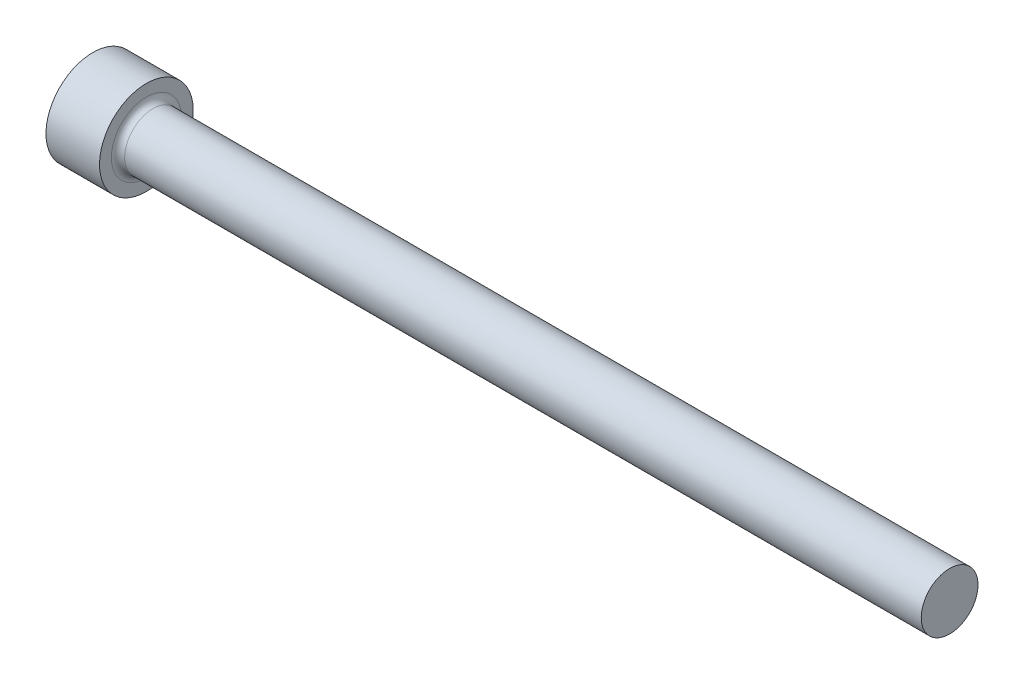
ISO-10303-21;
HEADER;
FILE_DESCRIPTION(('STEP AP214'),'2;1');
FILE_NAME('part.step','',(''),(''),'','','');
FILE_SCHEMA(('AUTOMOTIVE_DESIGN { 1 0 10303 214 1 1 1 1 }'));
ENDSEC;
DATA;
#1=APPLICATION_CONTEXT('core data for automotive mechanical design processes');
#2=APPLICATION_PROTOCOL_DEFINITION('international standard','automotive_design',2000,#1);
#3=PRODUCT_CONTEXT('',#1,'mechanical');
#4=PRODUCT('Part','Part','',(#3));
#5=PRODUCT_RELATED_PRODUCT_CATEGORY('part','',(#4));
#6=PRODUCT_DEFINITION_FORMATION('','',#4);
#7=PRODUCT_DEFINITION_CONTEXT('part definition',#1,'design');
#8=PRODUCT_DEFINITION('design','',#6,#7);
#9=PRODUCT_DEFINITION_SHAPE('','',#8);
#10=(LENGTH_UNIT() NAMED_UNIT(*) SI_UNIT(.MILLI.,.METRE.));
#11=(NAMED_UNIT(*) PLANE_ANGLE_UNIT() SI_UNIT($,.RADIAN.));
#12=(NAMED_UNIT(*) SI_UNIT($,.STERADIAN.) SOLID_ANGLE_UNIT());
#13=UNCERTAINTY_MEASURE_WITH_UNIT(LENGTH_MEASURE(1.E-05),#10,'distance_accuracy_value','');
#14=(GEOMETRIC_REPRESENTATION_CONTEXT(3) GLOBAL_UNCERTAINTY_ASSIGNED_CONTEXT((#13)) GLOBAL_UNIT_ASSIGNED_CONTEXT((#10,
#11,#12)) REPRESENTATION_CONTEXT('',''));
#15=CARTESIAN_POINT('',(0.,0.,0.));
#16=DIRECTION('',(0.,0.,1.));
#17=DIRECTION('',(1.,0.,0.));
#18=AXIS2_PLACEMENT_3D('',#15,#16,#17);
#19=CARTESIAN_POINT('',(0.,0.,0.));
#20=DIRECTION('',(1.,0.,0.));
#21=DIRECTION('',(0.,1.,0.));
#22=AXIS2_PLACEMENT_3D('',#19,#20,#21);
#23=PLANE('',#22);
#24=CARTESIAN_POINT('',(0.,0.,0.));
#25=DIRECTION('',(-1.,0.,0.));
#26=DIRECTION('',(0.,-1.,0.));
#27=AXIS2_PLACEMENT_3D('',#24,#25,#26);
#28=CIRCLE('',#27,5.55624999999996);
#29=CARTESIAN_POINT('',(0.,-5.55624999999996,0.));
#30=VERTEX_POINT('',#29);
#31=EDGE_CURVE('E10',#30,#30,#28,.T.);
#32=ORIENTED_EDGE('',*,*,#31,.T.);
#33=EDGE_LOOP('',(#32));
#34=FACE_BOUND('',#33,.T.);
#35=ADVANCED_FACE('F29',(#34),#23,.F.);
#36=CARTESIAN_POINT('',(101.6,0.,0.));
#37=DIRECTION('',(-1.,0.,0.));
#38=DIRECTION('',(0.,-1.,0.));
#39=AXIS2_PLACEMENT_3D('',#36,#37,#38);
#40=CYLINDRICAL_SURFACE('',#39,5.55624999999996);
#41=ORIENTED_EDGE('',*,*,#31,.F.);
#42=EDGE_LOOP('',(#41));
#43=FACE_BOUND('',#42,.T.);
#44=CARTESIAN_POINT('',(6.34999999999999,0.,0.));
#45=DIRECTION('',(-1.,0.,0.));
#46=DIRECTION('',(0.,-1.,0.));
#47=AXIS2_PLACEMENT_3D('',#44,#45,#46);
#48=CIRCLE('',#47,5.55624999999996);
#49=CARTESIAN_POINT('',(6.34999999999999,-5.55624999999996,0.));
#50=VERTEX_POINT('',#49);
#51=EDGE_CURVE('E35',#50,#50,#48,.T.);
#52=ORIENTED_EDGE('',*,*,#51,.T.);
#53=EDGE_LOOP('',(#52));
#54=FACE_BOUND('',#53,.T.);
#55=ADVANCED_FACE('F64',(#43,#54),#40,.T.);
#56=CARTESIAN_POINT('',(6.35,5.55624999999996,0.));
#57=DIRECTION('',(-1.,0.,0.));
#58=DIRECTION('',(0.,-1.,0.));
#59=AXIS2_PLACEMENT_3D('',#56,#57,#58);
#60=PLANE('',#59);
#61=ORIENTED_EDGE('',*,*,#51,.F.);
#62=EDGE_LOOP('',(#61));
#63=FACE_BOUND('',#62,.T.);
#64=CARTESIAN_POINT('',(6.34999999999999,0.,0.));
#65=DIRECTION('',(-1.,0.,0.));
#66=DIRECTION('',(0.,-1.,0.));
#67=AXIS2_PLACEMENT_3D('',#64,#65,#66);
#68=CIRCLE('',#67,4.15417);
#69=CARTESIAN_POINT('',(6.34999999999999,-4.15417,0.));
#70=VERTEX_POINT('',#69);
#71=EDGE_CURVE('E39',#70,#70,#68,.T.);
#72=ORIENTED_EDGE('',*,*,#71,.T.);
#73=EDGE_LOOP('',(#72));
#74=FACE_BOUND('',#73,.T.);
#75=ADVANCED_FACE('F68',(#63,#74),#60,.F.);
#76=CARTESIAN_POINT('',(7.1374,0.,0.));
#77=DIRECTION('',(-1.,0.,0.));
#78=DIRECTION('',(0.,-1.,0.));
#79=AXIS2_PLACEMENT_3D('',#76,#77,#78);
#80=TOROIDAL_SURFACE('',#79,4.15417,0.787399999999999);
#81=ORIENTED_EDGE('',*,*,#71,.F.);
#82=EDGE_LOOP('',(#81));
#83=FACE_BOUND('',#82,.T.);
#84=CARTESIAN_POINT('',(7.1374,0.,0.));
#85=DIRECTION('',(-1.,0.,0.));
#86=DIRECTION('',(0.,-1.,0.));
#87=AXIS2_PLACEMENT_3D('',#84,#85,#86);
#88=CIRCLE('',#87,3.36677);
#89=CARTESIAN_POINT('',(7.1374,-3.36677,0.));
#90=VERTEX_POINT('',#89);
#91=EDGE_CURVE('E43',#90,#90,#88,.T.);
#92=ORIENTED_EDGE('',*,*,#91,.T.);
#93=EDGE_LOOP('',(#92));
#94=FACE_BOUND('',#93,.T.);
#95=ADVANCED_FACE('F60',(#83,#94),#80,.F.);
#96=CARTESIAN_POINT('',(101.6,0.,0.));
#97=DIRECTION('',(-1.,0.,0.));
#98=DIRECTION('',(0.,-1.,0.));
#99=AXIS2_PLACEMENT_3D('',#96,#97,#98);
#100=CYLINDRICAL_SURFACE('',#99,3.36677000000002);
#101=ORIENTED_EDGE('',*,*,#91,.F.);
#102=EDGE_LOOP('',(#101));
#103=FACE_BOUND('',#102,.T.);
#104=CARTESIAN_POINT('',(101.6,0.,0.));
#105=DIRECTION('',(-1.,0.,0.));
#106=DIRECTION('',(0.,-1.,0.));
#107=AXIS2_PLACEMENT_3D('',#104,#105,#106);
#108=CIRCLE('',#107,3.36677000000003);
#109=CARTESIAN_POINT('',(101.6,-3.36677000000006,0.));
#110=VERTEX_POINT('',#109);
#111=EDGE_CURVE('E48',#110,#110,#108,.T.);
#112=ORIENTED_EDGE('',*,*,#111,.T.);
#113=EDGE_LOOP('',(#112));
#114=FACE_BOUND('',#113,.T.);
#115=ADVANCED_FACE('F52',(#103,#114),#100,.T.);
#116=CARTESIAN_POINT('',(101.6,3.36677,0.));
#117=DIRECTION('',(-1.,0.,0.));
#118=DIRECTION('',(0.,-1.,0.));
#119=AXIS2_PLACEMENT_3D('',#116,#117,#118);
#120=PLANE('',#119);
#121=ORIENTED_EDGE('',*,*,#111,.F.);
#122=EDGE_LOOP('',(#121));
#123=FACE_BOUND('',#122,.T.);
#124=ADVANCED_FACE('F54',(#123),#120,.F.);
#125=CLOSED_SHELL('',(#35,#55,#75,#95,#115,#124));
#126=MANIFOLD_SOLID_BREP('B2',#125);
#127=ADVANCED_BREP_SHAPE_REPRESENTATION('',(#18,#126),#14);
#128=SHAPE_DEFINITION_REPRESENTATION(#9,#127);
ENDSEC;
END-ISO-10303-21;
